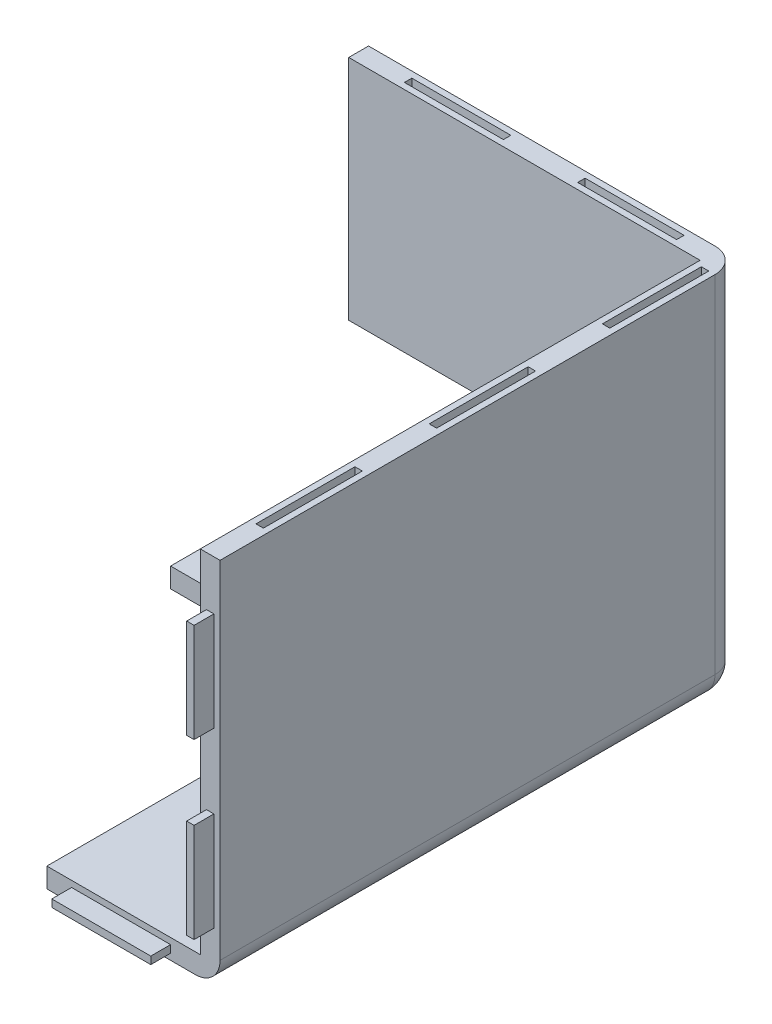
from build123d import *

# Parameters (mm, degrees)
CROQUIS1_W              = 150
CROQUIS1_H              = 210
SALIENTE_EXTRUIR1_DEPTH = 150
CROQUIS2_W              = 142
CROQUIS2_H              = 202
CORTAR_EXTRUIR1_DEPTH   = 142
CROQUIS9_W              = 3
CROQUIS9_H              = 40
CROQUIS9_W_2            = 40
CROQUIS9_H_2            = 3
CORTAR_EXTRUIR5_DEPTH   = 8
CROQUIS10_W             = 3
CROQUIS10_H             = 40
CROQUIS10_W_2           = 40
CROQUIS10_H_2           = 3
SALIENTE_EXTRUIR6_DEPTH = 8
REDONDEO2_R             = 10
CROQUIS11_W             = 80
CROQUIS11_H             = 138
CORTAR_EXTRUIR6_DEPTH   = 10
CROQUIS8_W              = 40
CROQUIS8_H              = 3
CROQUIS8_W_2            = 3
CROQUIS8_H_2            = 40
CORTAR_EXTRUIR7_DEPTH   = 10
CROQUIS12_W             = 50
CROQUIS12_H             = 50
CORTAR_EXTRUIR8_DEPTH   = 10
CROQUIS13_W             = 15
CROQUIS13_H             = 3
CROQUIS13_W_2           = 3
CROQUIS13_H_2           = 15
CORTAR_EXTRUIR9_DEPTH   = 6


with BuildPart() as part:
    # Croquis1 → Saliente-Extruir1 (new body)
    with BuildSketch(Plane(origin=(0, 0, 0), x_dir=(1, 0, 0), z_dir=(0, 1, 0))):
        with Locations((75, 105)):
            Rectangle(CROQUIS1_W, CROQUIS1_H)
    extrude(amount=SALIENTE_EXTRUIR1_DEPTH)

    # Croquis2 → Cortar-Extruir1 (cut)
    with BuildSketch(Plane(origin=(0, 150, 0), x_dir=(1, 0, 0), z_dir=(0, 1, 0))):
        with Locations((71, 101)):
            Rectangle(CROQUIS2_W, CROQUIS2_H)
    extrude(amount=-CORTAR_EXTRUIR1_DEPTH, mode=Mode.SUBTRACT)

    # Croquis9 → Cortar-Extruir5 (cut)
    with BuildSketch(Plane.ZY):
        with Locations((-206, 110)):
            Rectangle(CROQUIS9_W, CROQUIS9_H)
        with Locations((-40, 4)):
            Rectangle(CROQUIS9_W_2, CROQUIS9_H_2)
        with Locations((-110, 4)):
            Rectangle(CROQUIS9_W_2, CROQUIS9_H_2)
        with Locations((-180, 4)):
            Rectangle(CROQUIS9_W_2, CROQUIS9_H_2)
    extrude(amount=-CORTAR_EXTRUIR5_DEPTH, mode=Mode.SUBTRACT)

    # Croquis10 → Saliente-Extruir6 (add)
    with BuildSketch(Plane.XY):
        with Locations((146, 110)):
            Rectangle(CROQUIS10_W, CROQUIS10_H)
        with Locations((146, 40)):
            Rectangle(CROQUIS10_W, CROQUIS10_H)
        with Locations((40, 4)):
            Rectangle(CROQUIS10_W_2, CROQUIS10_H_2)
        with Locations((110, 4)):
            Rectangle(CROQUIS10_W_2, CROQUIS10_H_2)
    extrude(amount=SALIENTE_EXTRUIR6_DEPTH)

    # Redondeo2
    redondeo2_edges = [part.edges().sort_by_distance(p)[0] for p in [
        (75, 0, -210),
        (150, 0, -105),
        (150, 75, -210),
    ]]
    fillet(redondeo2_edges, radius=REDONDEO2_R)

    # Croquis11 → Cortar-Extruir6 (cut)
    with BuildSketch(Plane.XZ):
        with Locations((40, -61)):
            Rectangle(CROQUIS11_W, CROQUIS11_H)
    extrude(amount=-CORTAR_EXTRUIR6_DEPTH, mode=Mode.SUBTRACT)

    # Croquis8 → Cortar-Extruir7 (cut)
    with BuildSketch(Plane(origin=(0, 150, 0), x_dir=(1, 0, 0), z_dir=(0, 1, 0))):
        with Locations((40, 206)):
            Rectangle(CROQUIS8_W, CROQUIS8_H)
        with Locations((110, 206)):
            Rectangle(CROQUIS8_W, CROQUIS8_H)
        with Locations((146, 40)):
            Rectangle(CROQUIS8_W_2, CROQUIS8_H_2)
        with Locations((146, 110)):
            Rectangle(CROQUIS8_W_2, CROQUIS8_H_2)
        with Locations((146, 180)):
            Rectangle(CROQUIS8_W_2, CROQUIS8_H_2)
    extrude(amount=-CORTAR_EXTRUIR7_DEPTH, mode=Mode.SUBTRACT)

    # Croquis12 → Cortar-Extruir8 (cut)
    with BuildSketch(Plane(origin=(0, 0, -210), x_dir=(-1, 0, 0), z_dir=(0, 0, -1))):
        with Locations((-25, 33)):
            Rectangle(CROQUIS12_W, CROQUIS12_H)
    extrude(amount=-CORTAR_EXTRUIR8_DEPTH, mode=Mode.SUBTRACT)

    # Croquis13 → Cortar-Extruir9 (cut)
    with BuildSketch(Plane(origin=(0, 0, -210), x_dir=(-1, 0, 0), z_dir=(0, 0, -1))):
        with Locations((-35.5, 62)):
            Rectangle(CROQUIS13_W, CROQUIS13_H)
        with Locations((-12.5, 62)):
            Rectangle(CROQUIS13_W, CROQUIS13_H)
        with Locations((-54, 43.5)):
            Rectangle(CROQUIS13_W_2, CROQUIS13_H_2)
        with Locations((-54, 20.5)):
            Rectangle(CROQUIS13_W_2, CROQUIS13_H_2)
    extrude(amount=-CORTAR_EXTRUIR9_DEPTH, mode=Mode.SUBTRACT)


solid = part.part
